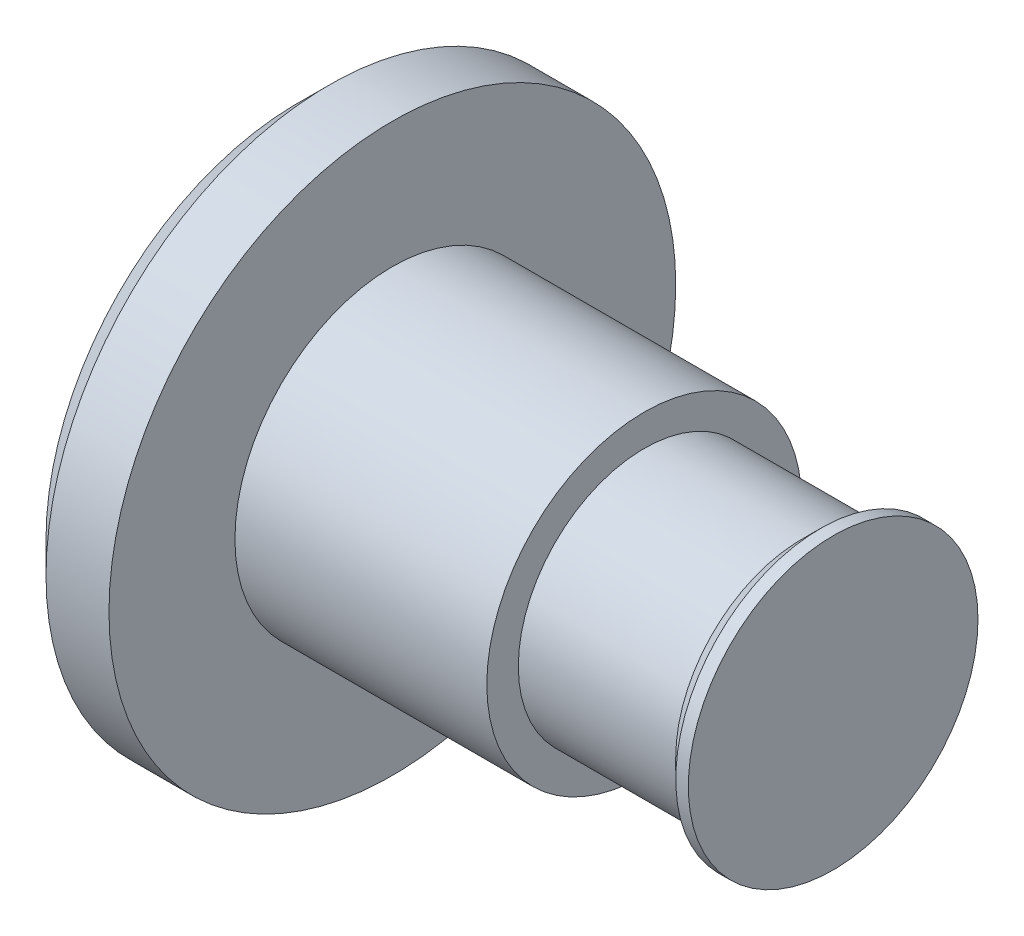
from build123d import *

# Parameters (mm, degrees)
ESQUISSE3_R             = 2.828427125
ESQUISSE3_R_2           = 2.3
ENL_V_MAT_EXTRU_2_DEPTH = 2


with BuildPart() as part:
    # Esquisse1 → Base-R_volution (revolve)
    with BuildSketch(Plane.XY, mode=Mode.PRIVATE) as base_r_volution_sk:
        Polygon((0, 0), (0, 4), (0.5, 4.5), (1.5, 4.5), (1.5, 2.5), (5.5, 2.5), (5.5, 2), (8, 2), (8.5, 2.5), (8.5, 0), align=None)
    revolve(base_r_volution_sk.sketch.rotate(Axis((-1.4, 0, 0), (1, 0, 0)), 90), axis=Axis((-1.4, 0, 0), (1, 0, 0)))

    # Esquisse3 → Enl_v. mat.-Extru.2 (cut)
    with BuildSketch(Plane(origin=(8.5, 0, 0), x_dir=(0, 0, -1), z_dir=(1, 0, 0))):
        Circle(ESQUISSE3_R)
        Circle(ESQUISSE3_R_2, mode=Mode.SUBTRACT)
    extrude(amount=-ENL_V_MAT_EXTRU_2_DEPTH, mode=Mode.SUBTRACT)


solid = part.part
